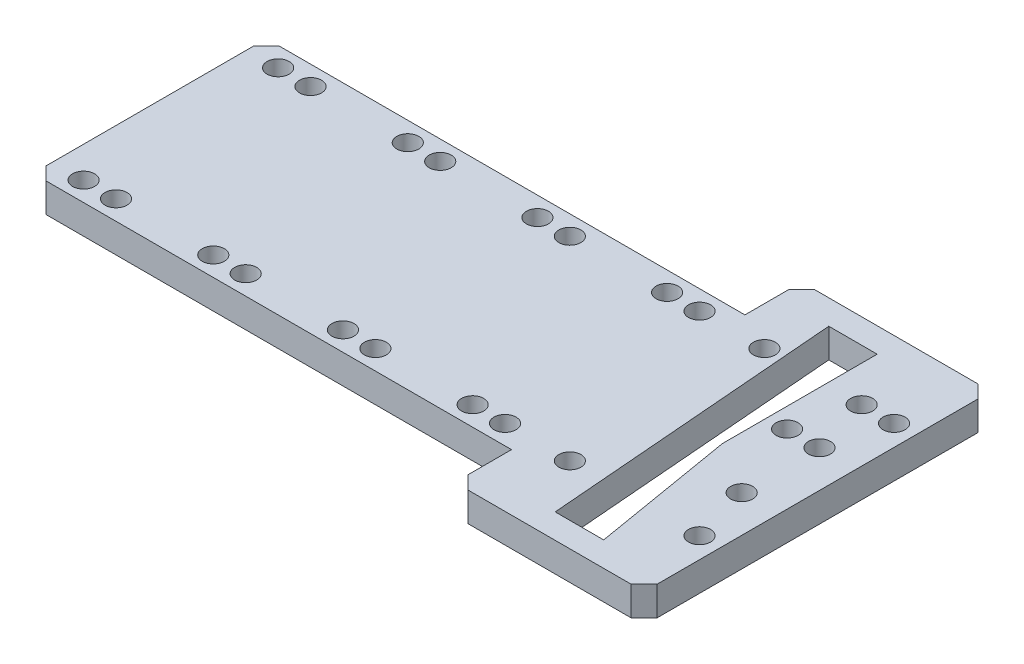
ISO-10303-21;
HEADER;
FILE_DESCRIPTION(('STEP AP214'),'2;1');
FILE_NAME('part.step','',(''),(''),'','','');
FILE_SCHEMA(('AUTOMOTIVE_DESIGN { 1 0 10303 214 1 1 1 1 }'));
ENDSEC;
DATA;
#1=APPLICATION_CONTEXT('core data for automotive mechanical design processes');
#2=APPLICATION_PROTOCOL_DEFINITION('international standard','automotive_design',2000,#1);
#3=PRODUCT_CONTEXT('',#1,'mechanical');
#4=PRODUCT('Part','Part','',(#3));
#5=PRODUCT_RELATED_PRODUCT_CATEGORY('part','',(#4));
#6=PRODUCT_DEFINITION_FORMATION('','',#4);
#7=PRODUCT_DEFINITION_CONTEXT('part definition',#1,'design');
#8=PRODUCT_DEFINITION('design','',#6,#7);
#9=PRODUCT_DEFINITION_SHAPE('','',#8);
#10=(LENGTH_UNIT() NAMED_UNIT(*) SI_UNIT(.MILLI.,.METRE.));
#11=(NAMED_UNIT(*) PLANE_ANGLE_UNIT() SI_UNIT($,.RADIAN.));
#12=(NAMED_UNIT(*) SI_UNIT($,.STERADIAN.) SOLID_ANGLE_UNIT());
#13=UNCERTAINTY_MEASURE_WITH_UNIT(LENGTH_MEASURE(1.E-05),#10,'distance_accuracy_value','');
#14=(GEOMETRIC_REPRESENTATION_CONTEXT(3) GLOBAL_UNCERTAINTY_ASSIGNED_CONTEXT((#13)) GLOBAL_UNIT_ASSIGNED_CONTEXT((#10,
#11,#12)) REPRESENTATION_CONTEXT('',''));
#15=CARTESIAN_POINT('',(0.,0.,0.));
#16=DIRECTION('',(0.,0.,1.));
#17=DIRECTION('',(1.,0.,0.));
#18=AXIS2_PLACEMENT_3D('',#15,#16,#17);
#19=CARTESIAN_POINT('',(0.,4.5,0.));
#20=DIRECTION('',(0.,1.,0.));
#21=DIRECTION('',(0.,0.,1.));
#22=AXIS2_PLACEMENT_3D('',#19,#20,#21);
#23=PLANE('',#22);
#24=CARTESIAN_POINT('',(51.3,4.5,-6.00000000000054));
#25=DIRECTION('',(0.,1.,0.));
#26=DIRECTION('',(0.,0.,1.));
#27=AXIS2_PLACEMENT_3D('',#24,#25,#26);
#28=CIRCLE('',#27,1.7);
#29=CARTESIAN_POINT('',(51.3,4.5,-4.30000000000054));
#30=VERTEX_POINT('',#29);
#31=EDGE_CURVE('E802',#30,#30,#28,.T.);
#32=ORIENTED_EDGE('',*,*,#31,.F.);
#33=EDGE_LOOP('',(#32));
#34=FACE_BOUND('',#33,.T.);
#35=CARTESIAN_POINT('',(33.8,4.5,-14.9999999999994));
#36=DIRECTION('',(0.,1.,0.));
#37=DIRECTION('',(0.,0.,1.));
#38=AXIS2_PLACEMENT_3D('',#35,#36,#37);
#39=CIRCLE('',#38,1.7000000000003);
#40=CARTESIAN_POINT('',(33.8,4.5,-13.2999999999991));
#41=VERTEX_POINT('',#40);
#42=EDGE_CURVE('E814',#41,#41,#39,.T.);
#43=ORIENTED_EDGE('',*,*,#42,.F.);
#44=EDGE_LOOP('',(#43));
#45=FACE_BOUND('',#44,.T.);
#46=CARTESIAN_POINT('',(-21.2,4.5,14.9999999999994));
#47=DIRECTION('',(0.,1.,0.));
#48=DIRECTION('',(0.,0.,-1.));
#49=AXIS2_PLACEMENT_3D('',#46,#47,#48);
#50=CIRCLE('',#49,1.7);
#51=CARTESIAN_POINT('',(-21.2,4.5,13.2999999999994));
#52=VERTEX_POINT('',#51);
#53=EDGE_CURVE('E826',#52,#52,#50,.T.);
#54=ORIENTED_EDGE('',*,*,#53,.F.);
#55=EDGE_LOOP('',(#54));
#56=FACE_BOUND('',#55,.T.);
#57=CARTESIAN_POINT('',(-36.2,4.5,14.9999999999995));
#58=DIRECTION('',(0.,1.,0.));
#59=DIRECTION('',(0.,0.,-1.));
#60=AXIS2_PLACEMENT_3D('',#57,#58,#59);
#61=CIRCLE('',#60,1.7);
#62=CARTESIAN_POINT('',(-36.2,4.5,13.2999999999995));
#63=VERTEX_POINT('',#62);
#64=EDGE_CURVE('E838',#63,#63,#61,.T.);
#65=ORIENTED_EDGE('',*,*,#64,.F.);
#66=EDGE_LOOP('',(#65));
#67=FACE_BOUND('',#66,.T.);
#68=CARTESIAN_POINT('',(-1.19999999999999,4.5,14.9999999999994));
#69=DIRECTION('',(0.,1.,0.));
#70=DIRECTION('',(0.,0.,-1.));
#71=AXIS2_PLACEMENT_3D('',#68,#69,#70);
#72=CIRCLE('',#71,1.7);
#73=CARTESIAN_POINT('',(-1.19999999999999,4.5,13.2999999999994));
#74=VERTEX_POINT('',#73);
#75=EDGE_CURVE('E850',#74,#74,#72,.T.);
#76=ORIENTED_EDGE('',*,*,#75,.F.);
#77=EDGE_LOOP('',(#76));
#78=FACE_BOUND('',#77,.T.);
#79=CARTESIAN_POINT('',(-41.2,4.5,-14.9999999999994));
#80=DIRECTION('',(0.,1.,0.));
#81=DIRECTION('',(0.,0.,1.));
#82=AXIS2_PLACEMENT_3D('',#79,#80,#81);
#83=CIRCLE('',#82,1.7);
#84=CARTESIAN_POINT('',(-41.2,4.5,-13.2999999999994));
#85=VERTEX_POINT('',#84);
#86=EDGE_CURVE('E862',#85,#85,#83,.T.);
#87=ORIENTED_EDGE('',*,*,#86,.F.);
#88=EDGE_LOOP('',(#87));
#89=FACE_BOUND('',#88,.T.);
#90=CARTESIAN_POINT('',(23.8,4.5,14.9999999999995));
#91=DIRECTION('',(0.,1.,0.));
#92=DIRECTION('',(0.,0.,-1.));
#93=AXIS2_PLACEMENT_3D('',#90,#91,#92);
#94=CIRCLE('',#93,1.7);
#95=CARTESIAN_POINT('',(23.8,4.5,13.2999999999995));
#96=VERTEX_POINT('',#95);
#97=EDGE_CURVE('E874',#96,#96,#94,.T.);
#98=ORIENTED_EDGE('',*,*,#97,.F.);
#99=EDGE_LOOP('',(#98));
#100=FACE_BOUND('',#99,.T.);
#101=CARTESIAN_POINT('',(23.8,4.5,-14.9999999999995));
#102=DIRECTION('',(0.,1.,0.));
#103=DIRECTION('',(0.,0.,1.));
#104=AXIS2_PLACEMENT_3D('',#101,#102,#103);
#105=CIRCLE('',#104,1.7);
#106=CARTESIAN_POINT('',(23.8,4.5,-13.2999999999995));
#107=VERTEX_POINT('',#106);
#108=EDGE_CURVE('E886',#107,#107,#105,.T.);
#109=ORIENTED_EDGE('',*,*,#108,.F.);
#110=EDGE_LOOP('',(#109));
#111=FACE_BOUND('',#110,.T.);
#112=CARTESIAN_POINT('',(3.80000000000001,4.5,-14.9999999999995));
#113=DIRECTION('',(0.,1.,0.));
#114=DIRECTION('',(0.,0.,1.));
#115=AXIS2_PLACEMENT_3D('',#112,#113,#114);
#116=CIRCLE('',#115,1.7);
#117=CARTESIAN_POINT('',(3.80000000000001,4.5,-13.2999999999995));
#118=VERTEX_POINT('',#117);
#119=EDGE_CURVE('E898',#118,#118,#116,.T.);
#120=ORIENTED_EDGE('',*,*,#119,.F.);
#121=EDGE_LOOP('',(#120));
#122=FACE_BOUND('',#121,.T.);
#123=CARTESIAN_POINT('',(-16.2,4.5,-14.9999999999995));
#124=DIRECTION('',(0.,1.,0.));
#125=DIRECTION('',(0.,0.,1.));
#126=AXIS2_PLACEMENT_3D('',#123,#124,#125);
#127=CIRCLE('',#126,1.7);
#128=CARTESIAN_POINT('',(-16.2,4.5,-13.2999999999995));
#129=VERTEX_POINT('',#128);
#130=EDGE_CURVE('E910',#129,#129,#127,.T.);
#131=ORIENTED_EDGE('',*,*,#130,.F.);
#132=EDGE_LOOP('',(#131));
#133=FACE_BOUND('',#132,.T.);
#134=CARTESIAN_POINT('',(53.8,4.5,14.9999999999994));
#135=DIRECTION('',(0.,1.,0.));
#136=DIRECTION('',(0.,0.,-1.));
#137=AXIS2_PLACEMENT_3D('',#134,#135,#136);
#138=CIRCLE('',#137,1.7000000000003);
#139=CARTESIAN_POINT('',(53.8,4.5,13.2999999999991));
#140=VERTEX_POINT('',#139);
#141=EDGE_CURVE('E922',#140,#140,#138,.T.);
#142=ORIENTED_EDGE('',*,*,#141,.F.);
#143=EDGE_LOOP('',(#142));
#144=FACE_BOUND('',#143,.T.);
#145=CARTESIAN_POINT('',(53.8,4.5,-14.9999999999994));
#146=DIRECTION('',(0.,1.,0.));
#147=DIRECTION('',(0.,0.,1.));
#148=AXIS2_PLACEMENT_3D('',#145,#146,#147);
#149=CIRCLE('',#148,1.7000000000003);
#150=CARTESIAN_POINT('',(53.8,4.5,-13.2999999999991));
#151=VERTEX_POINT('',#150);
#152=EDGE_CURVE('E196',#151,#151,#149,.T.);
#153=ORIENTED_EDGE('',*,*,#152,.F.);
#154=EDGE_LOOP('',(#153));
#155=FACE_BOUND('',#154,.T.);
#156=DIRECTION('',(0.,0.,-1.));
#157=VECTOR('',#156,1.);
#158=CARTESIAN_POINT('',(56.9999999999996,4.5,24.7499999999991));
#159=LINE('',#158,#157);
#160=CARTESIAN_POINT('',(56.9999999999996,4.5,24.7499999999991));
#161=VERTEX_POINT('',#160);
#162=CARTESIAN_POINT('',(57.0000000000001,4.5,-24.7500000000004));
#163=VERTEX_POINT('',#162);
#164=EDGE_CURVE('E211',#161,#163,#159,.T.);
#165=ORIENTED_EDGE('',*,*,#164,.T.);
#166=DIRECTION('',(-0.707106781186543,0.,-0.707106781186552));
#167=VECTOR('',#166,1.);
#168=CARTESIAN_POINT('',(57.0000000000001,4.5,-24.7500000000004));
#169=LINE('',#168,#167);
#170=CARTESIAN_POINT('',(55.0000000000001,4.5,-26.7500000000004));
#171=VERTEX_POINT('',#170);
#172=EDGE_CURVE('E214',#163,#171,#169,.T.);
#173=ORIENTED_EDGE('',*,*,#172,.T.);
#174=DIRECTION('',(-1.,0.,0.));
#175=VECTOR('',#174,1.);
#176=CARTESIAN_POINT('',(55.0000000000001,4.5,-26.7500000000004));
#177=LINE('',#176,#175);
#178=CARTESIAN_POINT('',(29.8,4.5,-26.7500000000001));
#179=VERTEX_POINT('',#178);
#180=EDGE_CURVE('E217',#171,#179,#177,.T.);
#181=ORIENTED_EDGE('',*,*,#180,.T.);
#182=DIRECTION('',(-0.707106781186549,0.,0.707106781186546));
#183=VECTOR('',#182,1.);
#184=CARTESIAN_POINT('',(27.8,4.5,-24.7500000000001));
#185=LINE('',#184,#183);
#186=CARTESIAN_POINT('',(27.8,4.5,-24.7500000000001));
#187=VERTEX_POINT('',#186);
#188=EDGE_CURVE('E219',#179,#187,#185,.T.);
#189=ORIENTED_EDGE('',*,*,#188,.T.);
#190=DIRECTION('',(0.,0.,1.));
#191=VECTOR('',#190,1.);
#192=CARTESIAN_POINT('',(27.7999999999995,4.5,-17.9999999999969));
#193=LINE('',#192,#191);
#194=CARTESIAN_POINT('',(27.7999999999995,4.5,-17.9999999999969));
#195=VERTEX_POINT('',#194);
#196=EDGE_CURVE('E221',#187,#195,#193,.T.);
#197=ORIENTED_EDGE('',*,*,#196,.T.);
#198=DIRECTION('',(-1.,0.,0.));
#199=VECTOR('',#198,1.);
#200=CARTESIAN_POINT('',(-43.9999999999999,4.5,-17.9999999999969));
#201=LINE('',#200,#199);
#202=CARTESIAN_POINT('',(-43.9999999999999,4.5,-17.9999999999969));
#203=VERTEX_POINT('',#202);
#204=EDGE_CURVE('E223',#195,#203,#201,.T.);
#205=ORIENTED_EDGE('',*,*,#204,.T.);
#206=DIRECTION('',(-0.707106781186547,0.,0.707106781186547));
#207=VECTOR('',#206,1.);
#208=CARTESIAN_POINT('',(-43.9999999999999,4.5,-17.9999999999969));
#209=LINE('',#208,#207);
#210=CARTESIAN_POINT('',(-45.9999999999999,4.5,-15.9999999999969));
#211=VERTEX_POINT('',#210);
#212=EDGE_CURVE('E225',#203,#211,#209,.T.);
#213=ORIENTED_EDGE('',*,*,#212,.T.);
#214=DIRECTION('',(0.,0.,1.));
#215=VECTOR('',#214,1.);
#216=CARTESIAN_POINT('',(-45.9999999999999,4.5,-15.9999999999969));
#217=LINE('',#216,#215);
#218=CARTESIAN_POINT('',(-45.9999999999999,4.5,15.9999999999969));
#219=VERTEX_POINT('',#218);
#220=EDGE_CURVE('E227',#211,#219,#217,.T.);
#221=ORIENTED_EDGE('',*,*,#220,.T.);
#222=DIRECTION('',(0.707106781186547,0.,0.707106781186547));
#223=VECTOR('',#222,1.);
#224=CARTESIAN_POINT('',(-45.9999999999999,4.5,15.9999999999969));
#225=LINE('',#224,#223);
#226=CARTESIAN_POINT('',(-43.9999999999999,4.5,17.9999999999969));
#227=VERTEX_POINT('',#226);
#228=EDGE_CURVE('E229',#219,#227,#225,.T.);
#229=ORIENTED_EDGE('',*,*,#228,.T.);
#230=DIRECTION('',(1.,0.,0.));
#231=VECTOR('',#230,1.);
#232=CARTESIAN_POINT('',(-43.9999999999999,4.5,17.9999999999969));
#233=LINE('',#232,#231);
#234=CARTESIAN_POINT('',(27.7999999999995,4.5,17.9999999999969));
#235=VERTEX_POINT('',#234);
#236=EDGE_CURVE('E231',#227,#235,#233,.T.);
#237=ORIENTED_EDGE('',*,*,#236,.T.);
#238=DIRECTION('',(0.,0.,1.));
#239=VECTOR('',#238,1.);
#240=CARTESIAN_POINT('',(27.7999999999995,4.5,17.9999999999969));
#241=LINE('',#240,#239);
#242=CARTESIAN_POINT('',(27.7999999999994,4.5,24.7499999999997));
#243=VERTEX_POINT('',#242);
#244=EDGE_CURVE('E233',#235,#243,#241,.T.);
#245=ORIENTED_EDGE('',*,*,#244,.T.);
#246=DIRECTION('',(0.707106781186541,0.,0.707106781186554));
#247=VECTOR('',#246,1.);
#248=CARTESIAN_POINT('',(27.7999999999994,4.5,24.7499999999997));
#249=LINE('',#248,#247);
#250=CARTESIAN_POINT('',(29.7999999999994,4.5,26.7499999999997));
#251=VERTEX_POINT('',#250);
#252=EDGE_CURVE('E235',#243,#251,#249,.T.);
#253=ORIENTED_EDGE('',*,*,#252,.T.);
#254=DIRECTION('',(1.,0.,0.));
#255=VECTOR('',#254,1.);
#256=CARTESIAN_POINT('',(54.9999999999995,4.5,26.7499999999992));
#257=LINE('',#256,#255);
#258=CARTESIAN_POINT('',(54.9999999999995,4.5,26.7499999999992));
#259=VERTEX_POINT('',#258);
#260=EDGE_CURVE('E237',#251,#259,#257,.T.);
#261=ORIENTED_EDGE('',*,*,#260,.T.);
#262=DIRECTION('',(0.707106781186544,0.,-0.707106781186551));
#263=VECTOR('',#262,1.);
#264=CARTESIAN_POINT('',(54.9999999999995,4.5,26.7499999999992));
#265=LINE('',#264,#263);
#266=EDGE_CURVE('E239',#259,#161,#265,.T.);
#267=ORIENTED_EDGE('',*,*,#266,.T.);
#268=EDGE_LOOP('',(#165,#173,#181,#189,#197,#205,#213,#221,#229,#237,#245,#253,#261,#267));
#269=FACE_BOUND('',#268,.T.);
#270=DIRECTION('',(-0.166195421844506,0.,-0.986092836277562));
#271=VECTOR('',#270,1.);
#272=CARTESIAN_POINT('',(43.25,4.5,0.912138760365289));
#273=LINE('',#272,#271);
#274=CARTESIAN_POINT('',(46.9642462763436,4.5,22.9500000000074));
#275=VERTEX_POINT('',#274);
#276=CARTESIAN_POINT('',(43.25,4.5,0.912138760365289));
#277=VERTEX_POINT('',#276);
#278=EDGE_CURVE('E172',#275,#277,#273,.T.);
#279=ORIENTED_EDGE('',*,*,#278,.F.);
#280=DIRECTION('',(1.,0.,0.));
#281=VECTOR('',#280,1.);
#282=CARTESIAN_POINT('',(46.9642462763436,4.5,22.9500000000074));
#283=LINE('',#282,#281);
#284=CARTESIAN_POINT('',(39.4842462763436,4.5,22.9500000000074));
#285=VERTEX_POINT('',#284);
#286=EDGE_CURVE('E164',#285,#275,#283,.T.);
#287=ORIENTED_EDGE('',*,*,#286,.F.);
#288=DIRECTION('',(0.0803714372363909,0.,0.996764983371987));
#289=VECTOR('',#288,1.);
#290=CARTESIAN_POINT('',(39.4842462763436,4.5,22.9500000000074));
#291=LINE('',#290,#289);
#292=CARTESIAN_POINT('',(35.7832244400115,4.5,-22.95));
#293=VERTEX_POINT('',#292);
#294=EDGE_CURVE('E193',#293,#285,#291,.T.);
#295=ORIENTED_EDGE('',*,*,#294,.F.);
#296=DIRECTION('',(-1.,0.,0.));
#297=VECTOR('',#296,1.);
#298=CARTESIAN_POINT('',(35.7832244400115,4.5,-22.95));
#299=LINE('',#298,#297);
#300=CARTESIAN_POINT('',(43.25,4.5,-22.95));
#301=VERTEX_POINT('',#300);
#302=EDGE_CURVE('E188',#301,#293,#299,.T.);
#303=ORIENTED_EDGE('',*,*,#302,.F.);
#304=DIRECTION('',(0.,0.,-1.));
#305=VECTOR('',#304,1.);
#306=CARTESIAN_POINT('',(43.25,4.5,-22.95));
#307=LINE('',#306,#305);
#308=EDGE_CURVE('E186',#277,#301,#307,.T.);
#309=ORIENTED_EDGE('',*,*,#308,.F.);
#310=EDGE_LOOP('',(#279,#287,#295,#303,#309));
#311=FACE_BOUND('',#310,.T.);
#312=CARTESIAN_POINT('',(48.8,4.5,-14.9999999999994));
#313=DIRECTION('',(0.,1.,0.));
#314=DIRECTION('',(0.,0.,1.));
#315=AXIS2_PLACEMENT_3D('',#312,#313,#314);
#316=CIRCLE('',#315,1.7000000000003);
#317=CARTESIAN_POINT('',(48.8,4.5,-13.2999999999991));
#318=VERTEX_POINT('',#317);
#319=EDGE_CURVE('E928',#318,#318,#316,.T.);
#320=ORIENTED_EDGE('',*,*,#319,.F.);
#321=EDGE_LOOP('',(#320));
#322=FACE_BOUND('',#321,.T.);
#323=CARTESIAN_POINT('',(-21.2,4.5,-14.9999999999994));
#324=DIRECTION('',(0.,1.,0.));
#325=DIRECTION('',(0.,0.,1.));
#326=AXIS2_PLACEMENT_3D('',#323,#324,#325);
#327=CIRCLE('',#326,1.7);
#328=CARTESIAN_POINT('',(-21.2,4.5,-13.2999999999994));
#329=VERTEX_POINT('',#328);
#330=EDGE_CURVE('E916',#329,#329,#327,.T.);
#331=ORIENTED_EDGE('',*,*,#330,.F.);
#332=EDGE_LOOP('',(#331));
#333=FACE_BOUND('',#332,.T.);
#334=CARTESIAN_POINT('',(-1.19999999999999,4.5,-14.9999999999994));
#335=DIRECTION('',(0.,1.,0.));
#336=DIRECTION('',(0.,0.,1.));
#337=AXIS2_PLACEMENT_3D('',#334,#335,#336);
#338=CIRCLE('',#337,1.7);
#339=CARTESIAN_POINT('',(-1.19999999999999,4.5,-13.2999999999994));
#340=VERTEX_POINT('',#339);
#341=EDGE_CURVE('E904',#340,#340,#338,.T.);
#342=ORIENTED_EDGE('',*,*,#341,.F.);
#343=EDGE_LOOP('',(#342));
#344=FACE_BOUND('',#343,.T.);
#345=CARTESIAN_POINT('',(18.8,4.5,-14.9999999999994));
#346=DIRECTION('',(0.,1.,0.));
#347=DIRECTION('',(0.,0.,1.));
#348=AXIS2_PLACEMENT_3D('',#345,#346,#347);
#349=CIRCLE('',#348,1.7);
#350=CARTESIAN_POINT('',(18.8,4.5,-13.2999999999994));
#351=VERTEX_POINT('',#350);
#352=EDGE_CURVE('E892',#351,#351,#349,.T.);
#353=ORIENTED_EDGE('',*,*,#352,.F.);
#354=EDGE_LOOP('',(#353));
#355=FACE_BOUND('',#354,.T.);
#356=CARTESIAN_POINT('',(33.8,4.5,14.9999999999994));
#357=DIRECTION('',(0.,1.,0.));
#358=DIRECTION('',(0.,0.,-1.));
#359=AXIS2_PLACEMENT_3D('',#356,#357,#358);
#360=CIRCLE('',#359,1.7000000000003);
#361=CARTESIAN_POINT('',(33.8,4.5,13.2999999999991));
#362=VERTEX_POINT('',#361);
#363=EDGE_CURVE('E880',#362,#362,#360,.T.);
#364=ORIENTED_EDGE('',*,*,#363,.F.);
#365=EDGE_LOOP('',(#364));
#366=FACE_BOUND('',#365,.T.);
#367=CARTESIAN_POINT('',(18.8,4.5,14.9999999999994));
#368=DIRECTION('',(0.,1.,0.));
#369=DIRECTION('',(0.,0.,-1.));
#370=AXIS2_PLACEMENT_3D('',#367,#368,#369);
#371=CIRCLE('',#370,1.7);
#372=CARTESIAN_POINT('',(18.8,4.5,13.2999999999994));
#373=VERTEX_POINT('',#372);
#374=EDGE_CURVE('E868',#373,#373,#371,.T.);
#375=ORIENTED_EDGE('',*,*,#374,.F.);
#376=EDGE_LOOP('',(#375));
#377=FACE_BOUND('',#376,.T.);
#378=CARTESIAN_POINT('',(3.80000000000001,4.5,14.9999999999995));
#379=DIRECTION('',(0.,1.,0.));
#380=DIRECTION('',(0.,0.,-1.));
#381=AXIS2_PLACEMENT_3D('',#378,#379,#380);
#382=CIRCLE('',#381,1.7);
#383=CARTESIAN_POINT('',(3.80000000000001,4.5,13.2999999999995));
#384=VERTEX_POINT('',#383);
#385=EDGE_CURVE('E856',#384,#384,#382,.T.);
#386=ORIENTED_EDGE('',*,*,#385,.F.);
#387=EDGE_LOOP('',(#386));
#388=FACE_BOUND('',#387,.T.);
#389=CARTESIAN_POINT('',(-36.2,4.5,-14.9999999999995));
#390=DIRECTION('',(0.,1.,0.));
#391=DIRECTION('',(0.,0.,1.));
#392=AXIS2_PLACEMENT_3D('',#389,#390,#391);
#393=CIRCLE('',#392,1.7);
#394=CARTESIAN_POINT('',(-36.2,4.5,-13.2999999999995));
#395=VERTEX_POINT('',#394);
#396=EDGE_CURVE('E844',#395,#395,#393,.T.);
#397=ORIENTED_EDGE('',*,*,#396,.F.);
#398=EDGE_LOOP('',(#397));
#399=FACE_BOUND('',#398,.T.);
#400=CARTESIAN_POINT('',(-16.2,4.5,14.9999999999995));
#401=DIRECTION('',(0.,1.,0.));
#402=DIRECTION('',(0.,0.,-1.));
#403=AXIS2_PLACEMENT_3D('',#400,#401,#402);
#404=CIRCLE('',#403,1.7);
#405=CARTESIAN_POINT('',(-16.2,4.5,13.2999999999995));
#406=VERTEX_POINT('',#405);
#407=EDGE_CURVE('E832',#406,#406,#404,.T.);
#408=ORIENTED_EDGE('',*,*,#407,.F.);
#409=EDGE_LOOP('',(#408));
#410=FACE_BOUND('',#409,.T.);
#411=CARTESIAN_POINT('',(-41.2,4.5,14.9999999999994));
#412=DIRECTION('',(0.,1.,0.));
#413=DIRECTION('',(0.,0.,-1.));
#414=AXIS2_PLACEMENT_3D('',#411,#412,#413);
#415=CIRCLE('',#414,1.7);
#416=CARTESIAN_POINT('',(-41.2,4.5,13.2999999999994));
#417=VERTEX_POINT('',#416);
#418=EDGE_CURVE('E820',#417,#417,#415,.T.);
#419=ORIENTED_EDGE('',*,*,#418,.F.);
#420=EDGE_LOOP('',(#419));
#421=FACE_BOUND('',#420,.T.);
#422=CARTESIAN_POINT('',(46.3,4.5,-6.00000000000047));
#423=DIRECTION('',(0.,1.,0.));
#424=DIRECTION('',(0.,0.,1.));
#425=AXIS2_PLACEMENT_3D('',#422,#423,#424);
#426=CIRCLE('',#425,1.7);
#427=CARTESIAN_POINT('',(46.3,4.5,-4.30000000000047));
#428=VERTEX_POINT('',#427);
#429=EDGE_CURVE('E808',#428,#428,#426,.T.);
#430=ORIENTED_EDGE('',*,*,#429,.F.);
#431=EDGE_LOOP('',(#430));
#432=FACE_BOUND('',#431,.T.);
#433=CARTESIAN_POINT('',(51.3,4.5,5.99999999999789));
#434=DIRECTION('',(0.,1.,0.));
#435=DIRECTION('',(0.,0.,1.));
#436=AXIS2_PLACEMENT_3D('',#433,#434,#435);
#437=CIRCLE('',#436,1.7);
#438=CARTESIAN_POINT('',(51.3,4.5,7.69999999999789));
#439=VERTEX_POINT('',#438);
#440=EDGE_CURVE('E793',#439,#439,#437,.T.);
#441=ORIENTED_EDGE('',*,*,#440,.F.);
#442=EDGE_LOOP('',(#441));
#443=FACE_BOUND('',#442,.T.);
#444=ADVANCED_FACE('F33',(#34,#45,#56,#67,#78,#89,#100,#111,#122,#133,#144,#155,#269,#311,#322,
#333,#344,#355,#366,#377,#388,#399,#410,#421,#432,#443),#23,.T.);
#445=CARTESIAN_POINT('',(0.,0.,0.));
#446=DIRECTION('',(0.,1.,0.));
#447=DIRECTION('',(0.,0.,1.));
#448=AXIS2_PLACEMENT_3D('',#445,#446,#447);
#449=PLANE('',#448);
#450=CARTESIAN_POINT('',(51.3,0.,-6.00000000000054));
#451=DIRECTION('',(0.,1.,0.));
#452=DIRECTION('',(0.,0.,1.));
#453=AXIS2_PLACEMENT_3D('',#450,#451,#452);
#454=CIRCLE('',#453,1.7);
#455=CARTESIAN_POINT('',(51.3,0.,-4.30000000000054));
#456=VERTEX_POINT('',#455);
#457=EDGE_CURVE('E799',#456,#456,#454,.T.);
#458=ORIENTED_EDGE('',*,*,#457,.T.);
#459=EDGE_LOOP('',(#458));
#460=FACE_BOUND('',#459,.T.);
#461=CARTESIAN_POINT('',(33.8,0.,-14.9999999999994));
#462=DIRECTION('',(0.,1.,0.));
#463=DIRECTION('',(0.,0.,1.));
#464=AXIS2_PLACEMENT_3D('',#461,#462,#463);
#465=CIRCLE('',#464,1.7000000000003);
#466=CARTESIAN_POINT('',(33.8,0.,-13.2999999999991));
#467=VERTEX_POINT('',#466);
#468=EDGE_CURVE('E811',#467,#467,#465,.T.);
#469=ORIENTED_EDGE('',*,*,#468,.T.);
#470=EDGE_LOOP('',(#469));
#471=FACE_BOUND('',#470,.T.);
#472=CARTESIAN_POINT('',(-21.2,0.,14.9999999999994));
#473=DIRECTION('',(0.,1.,0.));
#474=DIRECTION('',(0.,0.,-1.));
#475=AXIS2_PLACEMENT_3D('',#472,#473,#474);
#476=CIRCLE('',#475,1.7);
#477=CARTESIAN_POINT('',(-21.2,0.,13.2999999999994));
#478=VERTEX_POINT('',#477);
#479=EDGE_CURVE('E823',#478,#478,#476,.T.);
#480=ORIENTED_EDGE('',*,*,#479,.T.);
#481=EDGE_LOOP('',(#480));
#482=FACE_BOUND('',#481,.T.);
#483=CARTESIAN_POINT('',(-36.2,0.,14.9999999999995));
#484=DIRECTION('',(0.,1.,0.));
#485=DIRECTION('',(0.,0.,-1.));
#486=AXIS2_PLACEMENT_3D('',#483,#484,#485);
#487=CIRCLE('',#486,1.7);
#488=CARTESIAN_POINT('',(-36.2,0.,13.2999999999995));
#489=VERTEX_POINT('',#488);
#490=EDGE_CURVE('E835',#489,#489,#487,.T.);
#491=ORIENTED_EDGE('',*,*,#490,.T.);
#492=EDGE_LOOP('',(#491));
#493=FACE_BOUND('',#492,.T.);
#494=CARTESIAN_POINT('',(-1.19999999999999,0.,14.9999999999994));
#495=DIRECTION('',(0.,1.,0.));
#496=DIRECTION('',(0.,0.,-1.));
#497=AXIS2_PLACEMENT_3D('',#494,#495,#496);
#498=CIRCLE('',#497,1.7);
#499=CARTESIAN_POINT('',(-1.19999999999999,0.,13.2999999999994));
#500=VERTEX_POINT('',#499);
#501=EDGE_CURVE('E847',#500,#500,#498,.T.);
#502=ORIENTED_EDGE('',*,*,#501,.T.);
#503=EDGE_LOOP('',(#502));
#504=FACE_BOUND('',#503,.T.);
#505=CARTESIAN_POINT('',(-41.2,0.,-14.9999999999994));
#506=DIRECTION('',(0.,1.,0.));
#507=DIRECTION('',(0.,0.,1.));
#508=AXIS2_PLACEMENT_3D('',#505,#506,#507);
#509=CIRCLE('',#508,1.7);
#510=CARTESIAN_POINT('',(-41.2,0.,-13.2999999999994));
#511=VERTEX_POINT('',#510);
#512=EDGE_CURVE('E859',#511,#511,#509,.T.);
#513=ORIENTED_EDGE('',*,*,#512,.T.);
#514=EDGE_LOOP('',(#513));
#515=FACE_BOUND('',#514,.T.);
#516=CARTESIAN_POINT('',(23.8,0.,14.9999999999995));
#517=DIRECTION('',(0.,1.,0.));
#518=DIRECTION('',(0.,0.,-1.));
#519=AXIS2_PLACEMENT_3D('',#516,#517,#518);
#520=CIRCLE('',#519,1.7);
#521=CARTESIAN_POINT('',(23.8,0.,13.2999999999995));
#522=VERTEX_POINT('',#521);
#523=EDGE_CURVE('E871',#522,#522,#520,.T.);
#524=ORIENTED_EDGE('',*,*,#523,.T.);
#525=EDGE_LOOP('',(#524));
#526=FACE_BOUND('',#525,.T.);
#527=CARTESIAN_POINT('',(23.8,0.,-14.9999999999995));
#528=DIRECTION('',(0.,1.,0.));
#529=DIRECTION('',(0.,0.,1.));
#530=AXIS2_PLACEMENT_3D('',#527,#528,#529);
#531=CIRCLE('',#530,1.7);
#532=CARTESIAN_POINT('',(23.8,0.,-13.2999999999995));
#533=VERTEX_POINT('',#532);
#534=EDGE_CURVE('E883',#533,#533,#531,.T.);
#535=ORIENTED_EDGE('',*,*,#534,.T.);
#536=EDGE_LOOP('',(#535));
#537=FACE_BOUND('',#536,.T.);
#538=CARTESIAN_POINT('',(3.80000000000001,0.,-14.9999999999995));
#539=DIRECTION('',(0.,1.,0.));
#540=DIRECTION('',(0.,0.,1.));
#541=AXIS2_PLACEMENT_3D('',#538,#539,#540);
#542=CIRCLE('',#541,1.7);
#543=CARTESIAN_POINT('',(3.80000000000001,0.,-13.2999999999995));
#544=VERTEX_POINT('',#543);
#545=EDGE_CURVE('E895',#544,#544,#542,.T.);
#546=ORIENTED_EDGE('',*,*,#545,.T.);
#547=EDGE_LOOP('',(#546));
#548=FACE_BOUND('',#547,.T.);
#549=CARTESIAN_POINT('',(-16.2,0.,-14.9999999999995));
#550=DIRECTION('',(0.,1.,0.));
#551=DIRECTION('',(0.,0.,1.));
#552=AXIS2_PLACEMENT_3D('',#549,#550,#551);
#553=CIRCLE('',#552,1.7);
#554=CARTESIAN_POINT('',(-16.2,0.,-13.2999999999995));
#555=VERTEX_POINT('',#554);
#556=EDGE_CURVE('E907',#555,#555,#553,.T.);
#557=ORIENTED_EDGE('',*,*,#556,.T.);
#558=EDGE_LOOP('',(#557));
#559=FACE_BOUND('',#558,.T.);
#560=CARTESIAN_POINT('',(53.8,0.,14.9999999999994));
#561=DIRECTION('',(0.,1.,0.));
#562=DIRECTION('',(0.,0.,-1.));
#563=AXIS2_PLACEMENT_3D('',#560,#561,#562);
#564=CIRCLE('',#563,1.7000000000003);
#565=CARTESIAN_POINT('',(53.8,0.,13.2999999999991));
#566=VERTEX_POINT('',#565);
#567=EDGE_CURVE('E919',#566,#566,#564,.T.);
#568=ORIENTED_EDGE('',*,*,#567,.T.);
#569=EDGE_LOOP('',(#568));
#570=FACE_BOUND('',#569,.T.);
#571=CARTESIAN_POINT('',(53.8,0.,-14.9999999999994));
#572=DIRECTION('',(0.,1.,0.));
#573=DIRECTION('',(0.,0.,1.));
#574=AXIS2_PLACEMENT_3D('',#571,#572,#573);
#575=CIRCLE('',#574,1.7000000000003);
#576=CARTESIAN_POINT('',(53.8,0.,-13.2999999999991));
#577=VERTEX_POINT('',#576);
#578=EDGE_CURVE('E931',#577,#577,#575,.T.);
#579=ORIENTED_EDGE('',*,*,#578,.T.);
#580=EDGE_LOOP('',(#579));
#581=FACE_BOUND('',#580,.T.);
#582=DIRECTION('',(0.,0.,-1.));
#583=VECTOR('',#582,1.);
#584=CARTESIAN_POINT('',(56.9999999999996,0.,24.7499999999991));
#585=LINE('',#584,#583);
#586=CARTESIAN_POINT('',(56.9999999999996,0.,24.7499999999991));
#587=VERTEX_POINT('',#586);
#588=CARTESIAN_POINT('',(57.0000000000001,0.,-24.7500000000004));
#589=VERTEX_POINT('',#588);
#590=EDGE_CURVE('E180',#587,#589,#585,.T.);
#591=ORIENTED_EDGE('',*,*,#590,.F.);
#592=DIRECTION('',(0.707106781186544,0.,-0.707106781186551));
#593=VECTOR('',#592,1.);
#594=CARTESIAN_POINT('',(54.9999999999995,0.,26.7499999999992));
#595=LINE('',#594,#593);
#596=CARTESIAN_POINT('',(54.9999999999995,0.,26.7499999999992));
#597=VERTEX_POINT('',#596);
#598=EDGE_CURVE('E215',#597,#587,#595,.T.);
#599=ORIENTED_EDGE('',*,*,#598,.F.);
#600=DIRECTION('',(1.,0.,0.));
#601=VECTOR('',#600,1.);
#602=CARTESIAN_POINT('',(54.9999999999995,0.,26.7499999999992));
#603=LINE('',#602,#601);
#604=CARTESIAN_POINT('',(29.7999999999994,0.,26.7499999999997));
#605=VERTEX_POINT('',#604);
#606=EDGE_CURVE('E266',#605,#597,#603,.T.);
#607=ORIENTED_EDGE('',*,*,#606,.F.);
#608=DIRECTION('',(0.707106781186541,0.,0.707106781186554));
#609=VECTOR('',#608,1.);
#610=CARTESIAN_POINT('',(27.7999999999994,0.,24.7499999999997));
#611=LINE('',#610,#609);
#612=CARTESIAN_POINT('',(27.7999999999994,0.,24.7499999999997));
#613=VERTEX_POINT('',#612);
#614=EDGE_CURVE('E264',#613,#605,#611,.T.);
#615=ORIENTED_EDGE('',*,*,#614,.F.);
#616=DIRECTION('',(0.,0.,1.));
#617=VECTOR('',#616,1.);
#618=CARTESIAN_POINT('',(27.7999999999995,0.,17.9999999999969));
#619=LINE('',#618,#617);
#620=CARTESIAN_POINT('',(27.7999999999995,0.,17.9999999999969));
#621=VERTEX_POINT('',#620);
#622=EDGE_CURVE('E262',#621,#613,#619,.T.);
#623=ORIENTED_EDGE('',*,*,#622,.F.);
#624=DIRECTION('',(1.,0.,0.));
#625=VECTOR('',#624,1.);
#626=CARTESIAN_POINT('',(-43.9999999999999,0.,17.9999999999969));
#627=LINE('',#626,#625);
#628=CARTESIAN_POINT('',(-43.9999999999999,0.,17.9999999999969));
#629=VERTEX_POINT('',#628);
#630=EDGE_CURVE('E260',#629,#621,#627,.T.);
#631=ORIENTED_EDGE('',*,*,#630,.F.);
#632=DIRECTION('',(0.707106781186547,0.,0.707106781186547));
#633=VECTOR('',#632,1.);
#634=CARTESIAN_POINT('',(-45.9999999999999,0.,15.9999999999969));
#635=LINE('',#634,#633);
#636=CARTESIAN_POINT('',(-45.9999999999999,0.,15.9999999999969));
#637=VERTEX_POINT('',#636);
#638=EDGE_CURVE('E258',#637,#629,#635,.T.);
#639=ORIENTED_EDGE('',*,*,#638,.F.);
#640=DIRECTION('',(0.,0.,1.));
#641=VECTOR('',#640,1.);
#642=CARTESIAN_POINT('',(-45.9999999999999,0.,-15.9999999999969));
#643=LINE('',#642,#641);
#644=CARTESIAN_POINT('',(-45.9999999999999,0.,-15.9999999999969));
#645=VERTEX_POINT('',#644);
#646=EDGE_CURVE('E256',#645,#637,#643,.T.);
#647=ORIENTED_EDGE('',*,*,#646,.F.);
#648=DIRECTION('',(-0.707106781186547,0.,0.707106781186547));
#649=VECTOR('',#648,1.);
#650=CARTESIAN_POINT('',(-43.9999999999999,0.,-17.9999999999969));
#651=LINE('',#650,#649);
#652=CARTESIAN_POINT('',(-43.9999999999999,0.,-17.9999999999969));
#653=VERTEX_POINT('',#652);
#654=EDGE_CURVE('E254',#653,#645,#651,.T.);
#655=ORIENTED_EDGE('',*,*,#654,.F.);
#656=DIRECTION('',(-1.,0.,0.));
#657=VECTOR('',#656,1.);
#658=CARTESIAN_POINT('',(-43.9999999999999,0.,-17.9999999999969));
#659=LINE('',#658,#657);
#660=CARTESIAN_POINT('',(27.7999999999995,0.,-17.9999999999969));
#661=VERTEX_POINT('',#660);
#662=EDGE_CURVE('E252',#661,#653,#659,.T.);
#663=ORIENTED_EDGE('',*,*,#662,.F.);
#664=DIRECTION('',(0.,0.,1.));
#665=VECTOR('',#664,1.);
#666=CARTESIAN_POINT('',(27.7999999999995,0.,-17.9999999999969));
#667=LINE('',#666,#665);
#668=CARTESIAN_POINT('',(27.8,0.,-24.7500000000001));
#669=VERTEX_POINT('',#668);
#670=EDGE_CURVE('E250',#669,#661,#667,.T.);
#671=ORIENTED_EDGE('',*,*,#670,.F.);
#672=DIRECTION('',(-0.707106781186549,0.,0.707106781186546));
#673=VECTOR('',#672,1.);
#674=CARTESIAN_POINT('',(27.8,0.,-24.7500000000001));
#675=LINE('',#674,#673);
#676=CARTESIAN_POINT('',(29.8,0.,-26.7500000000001));
#677=VERTEX_POINT('',#676);
#678=EDGE_CURVE('E248',#677,#669,#675,.T.);
#679=ORIENTED_EDGE('',*,*,#678,.F.);
#680=DIRECTION('',(-1.,0.,0.));
#681=VECTOR('',#680,1.);
#682=CARTESIAN_POINT('',(55.0000000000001,0.,-26.7500000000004));
#683=LINE('',#682,#681);
#684=CARTESIAN_POINT('',(55.0000000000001,0.,-26.7500000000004));
#685=VERTEX_POINT('',#684);
#686=EDGE_CURVE('E246',#685,#677,#683,.T.);
#687=ORIENTED_EDGE('',*,*,#686,.F.);
#688=DIRECTION('',(-0.707106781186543,0.,-0.707106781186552));
#689=VECTOR('',#688,1.);
#690=CARTESIAN_POINT('',(57.0000000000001,0.,-24.7500000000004));
#691=LINE('',#690,#689);
#692=EDGE_CURVE('E244',#589,#685,#691,.T.);
#693=ORIENTED_EDGE('',*,*,#692,.F.);
#694=EDGE_LOOP('',(#591,#599,#607,#615,#623,#631,#639,#647,#655,#663,#671,#679,#687,#693));
#695=FACE_BOUND('',#694,.T.);
#696=DIRECTION('',(1.,0.,0.));
#697=VECTOR('',#696,1.);
#698=CARTESIAN_POINT('',(46.9642462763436,0.,22.9500000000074));
#699=LINE('',#698,#697);
#700=CARTESIAN_POINT('',(39.4842462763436,0.,22.9500000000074));
#701=VERTEX_POINT('',#700);
#702=CARTESIAN_POINT('',(46.9642462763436,0.,22.9500000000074));
#703=VERTEX_POINT('',#702);
#704=EDGE_CURVE('E56',#701,#703,#699,.T.);
#705=ORIENTED_EDGE('',*,*,#704,.T.);
#706=DIRECTION('',(-0.166195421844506,0.,-0.986092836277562));
#707=VECTOR('',#706,1.);
#708=CARTESIAN_POINT('',(43.25,0.,0.912138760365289));
#709=LINE('',#708,#707);
#710=CARTESIAN_POINT('',(43.25,0.,0.912138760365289));
#711=VERTEX_POINT('',#710);
#712=EDGE_CURVE('E179',#703,#711,#709,.T.);
#713=ORIENTED_EDGE('',*,*,#712,.T.);
#714=DIRECTION('',(0.,0.,-1.));
#715=VECTOR('',#714,1.);
#716=CARTESIAN_POINT('',(43.25,0.,-22.95));
#717=LINE('',#716,#715);
#718=CARTESIAN_POINT('',(43.25,0.,-22.95));
#719=VERTEX_POINT('',#718);
#720=EDGE_CURVE('E198',#711,#719,#717,.T.);
#721=ORIENTED_EDGE('',*,*,#720,.T.);
#722=DIRECTION('',(-1.,0.,0.));
#723=VECTOR('',#722,1.);
#724=CARTESIAN_POINT('',(35.7832244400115,0.,-22.95));
#725=LINE('',#724,#723);
#726=CARTESIAN_POINT('',(35.7832244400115,0.,-22.95));
#727=VERTEX_POINT('',#726);
#728=EDGE_CURVE('E201',#719,#727,#725,.T.);
#729=ORIENTED_EDGE('',*,*,#728,.T.);
#730=DIRECTION('',(0.0803714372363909,0.,0.996764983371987));
#731=VECTOR('',#730,1.);
#732=CARTESIAN_POINT('',(39.4842462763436,0.,22.9500000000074));
#733=LINE('',#732,#731);
#734=EDGE_CURVE('E173',#727,#701,#733,.T.);
#735=ORIENTED_EDGE('',*,*,#734,.T.);
#736=EDGE_LOOP('',(#705,#713,#721,#729,#735));
#737=FACE_BOUND('',#736,.T.);
#738=CARTESIAN_POINT('',(48.8,0.,-14.9999999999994));
#739=DIRECTION('',(0.,1.,0.));
#740=DIRECTION('',(0.,0.,1.));
#741=AXIS2_PLACEMENT_3D('',#738,#739,#740);
#742=CIRCLE('',#741,1.7000000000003);
#743=CARTESIAN_POINT('',(48.8,0.,-13.2999999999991));
#744=VERTEX_POINT('',#743);
#745=EDGE_CURVE('E925',#744,#744,#742,.T.);
#746=ORIENTED_EDGE('',*,*,#745,.T.);
#747=EDGE_LOOP('',(#746));
#748=FACE_BOUND('',#747,.T.);
#749=CARTESIAN_POINT('',(-21.2,0.,-14.9999999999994));
#750=DIRECTION('',(0.,1.,0.));
#751=DIRECTION('',(0.,0.,1.));
#752=AXIS2_PLACEMENT_3D('',#749,#750,#751);
#753=CIRCLE('',#752,1.7);
#754=CARTESIAN_POINT('',(-21.2,0.,-13.2999999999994));
#755=VERTEX_POINT('',#754);
#756=EDGE_CURVE('E913',#755,#755,#753,.T.);
#757=ORIENTED_EDGE('',*,*,#756,.T.);
#758=EDGE_LOOP('',(#757));
#759=FACE_BOUND('',#758,.T.);
#760=CARTESIAN_POINT('',(-1.19999999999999,0.,-14.9999999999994));
#761=DIRECTION('',(0.,1.,0.));
#762=DIRECTION('',(0.,0.,1.));
#763=AXIS2_PLACEMENT_3D('',#760,#761,#762);
#764=CIRCLE('',#763,1.7);
#765=CARTESIAN_POINT('',(-1.19999999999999,0.,-13.2999999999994));
#766=VERTEX_POINT('',#765);
#767=EDGE_CURVE('E901',#766,#766,#764,.T.);
#768=ORIENTED_EDGE('',*,*,#767,.T.);
#769=EDGE_LOOP('',(#768));
#770=FACE_BOUND('',#769,.T.);
#771=CARTESIAN_POINT('',(18.8,0.,-14.9999999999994));
#772=DIRECTION('',(0.,1.,0.));
#773=DIRECTION('',(0.,0.,1.));
#774=AXIS2_PLACEMENT_3D('',#771,#772,#773);
#775=CIRCLE('',#774,1.7);
#776=CARTESIAN_POINT('',(18.8,0.,-13.2999999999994));
#777=VERTEX_POINT('',#776);
#778=EDGE_CURVE('E889',#777,#777,#775,.T.);
#779=ORIENTED_EDGE('',*,*,#778,.T.);
#780=EDGE_LOOP('',(#779));
#781=FACE_BOUND('',#780,.T.);
#782=CARTESIAN_POINT('',(33.8,0.,14.9999999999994));
#783=DIRECTION('',(0.,1.,0.));
#784=DIRECTION('',(0.,0.,-1.));
#785=AXIS2_PLACEMENT_3D('',#782,#783,#784);
#786=CIRCLE('',#785,1.7000000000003);
#787=CARTESIAN_POINT('',(33.8,0.,13.2999999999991));
#788=VERTEX_POINT('',#787);
#789=EDGE_CURVE('E877',#788,#788,#786,.T.);
#790=ORIENTED_EDGE('',*,*,#789,.T.);
#791=EDGE_LOOP('',(#790));
#792=FACE_BOUND('',#791,.T.);
#793=CARTESIAN_POINT('',(18.8,0.,14.9999999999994));
#794=DIRECTION('',(0.,1.,0.));
#795=DIRECTION('',(0.,0.,-1.));
#796=AXIS2_PLACEMENT_3D('',#793,#794,#795);
#797=CIRCLE('',#796,1.7);
#798=CARTESIAN_POINT('',(18.8,0.,13.2999999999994));
#799=VERTEX_POINT('',#798);
#800=EDGE_CURVE('E865',#799,#799,#797,.T.);
#801=ORIENTED_EDGE('',*,*,#800,.T.);
#802=EDGE_LOOP('',(#801));
#803=FACE_BOUND('',#802,.T.);
#804=CARTESIAN_POINT('',(3.80000000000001,0.,14.9999999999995));
#805=DIRECTION('',(0.,1.,0.));
#806=DIRECTION('',(0.,0.,-1.));
#807=AXIS2_PLACEMENT_3D('',#804,#805,#806);
#808=CIRCLE('',#807,1.7);
#809=CARTESIAN_POINT('',(3.80000000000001,0.,13.2999999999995));
#810=VERTEX_POINT('',#809);
#811=EDGE_CURVE('E853',#810,#810,#808,.T.);
#812=ORIENTED_EDGE('',*,*,#811,.T.);
#813=EDGE_LOOP('',(#812));
#814=FACE_BOUND('',#813,.T.);
#815=CARTESIAN_POINT('',(-36.2,0.,-14.9999999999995));
#816=DIRECTION('',(0.,1.,0.));
#817=DIRECTION('',(0.,0.,1.));
#818=AXIS2_PLACEMENT_3D('',#815,#816,#817);
#819=CIRCLE('',#818,1.7);
#820=CARTESIAN_POINT('',(-36.2,0.,-13.2999999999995));
#821=VERTEX_POINT('',#820);
#822=EDGE_CURVE('E841',#821,#821,#819,.T.);
#823=ORIENTED_EDGE('',*,*,#822,.T.);
#824=EDGE_LOOP('',(#823));
#825=FACE_BOUND('',#824,.T.);
#826=CARTESIAN_POINT('',(-16.2,0.,14.9999999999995));
#827=DIRECTION('',(0.,1.,0.));
#828=DIRECTION('',(0.,0.,-1.));
#829=AXIS2_PLACEMENT_3D('',#826,#827,#828);
#830=CIRCLE('',#829,1.7);
#831=CARTESIAN_POINT('',(-16.2,0.,13.2999999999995));
#832=VERTEX_POINT('',#831);
#833=EDGE_CURVE('E829',#832,#832,#830,.T.);
#834=ORIENTED_EDGE('',*,*,#833,.T.);
#835=EDGE_LOOP('',(#834));
#836=FACE_BOUND('',#835,.T.);
#837=CARTESIAN_POINT('',(-41.2,0.,14.9999999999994));
#838=DIRECTION('',(0.,1.,0.));
#839=DIRECTION('',(0.,0.,-1.));
#840=AXIS2_PLACEMENT_3D('',#837,#838,#839);
#841=CIRCLE('',#840,1.7);
#842=CARTESIAN_POINT('',(-41.2,0.,13.2999999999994));
#843=VERTEX_POINT('',#842);
#844=EDGE_CURVE('E817',#843,#843,#841,.T.);
#845=ORIENTED_EDGE('',*,*,#844,.T.);
#846=EDGE_LOOP('',(#845));
#847=FACE_BOUND('',#846,.T.);
#848=CARTESIAN_POINT('',(46.3,0.,-6.00000000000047));
#849=DIRECTION('',(0.,1.,0.));
#850=DIRECTION('',(0.,0.,1.));
#851=AXIS2_PLACEMENT_3D('',#848,#849,#850);
#852=CIRCLE('',#851,1.7);
#853=CARTESIAN_POINT('',(46.3,0.,-4.30000000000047));
#854=VERTEX_POINT('',#853);
#855=EDGE_CURVE('E805',#854,#854,#852,.T.);
#856=ORIENTED_EDGE('',*,*,#855,.T.);
#857=EDGE_LOOP('',(#856));
#858=FACE_BOUND('',#857,.T.);
#859=CARTESIAN_POINT('',(51.3,0.,5.99999999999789));
#860=DIRECTION('',(0.,1.,0.));
#861=DIRECTION('',(0.,0.,1.));
#862=AXIS2_PLACEMENT_3D('',#859,#860,#861);
#863=CIRCLE('',#862,1.7);
#864=CARTESIAN_POINT('',(51.3,0.,7.69999999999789));
#865=VERTEX_POINT('',#864);
#866=EDGE_CURVE('E796',#865,#865,#863,.T.);
#867=ORIENTED_EDGE('',*,*,#866,.T.);
#868=EDGE_LOOP('',(#867));
#869=FACE_BOUND('',#868,.T.);
#870=ADVANCED_FACE('F314',(#460,#471,#482,#493,#504,#515,#526,#537,#548,#559,#570,#581,#695,
#737,#748,#759,#770,#781,#792,#803,#814,#825,#836,#847,#858,#869),#449,.F.);
#871=CARTESIAN_POINT('',(56.9999999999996,4.5,24.7499999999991));
#872=DIRECTION('',(-1.,0.,0.));
#873=DIRECTION('',(0.,0.,1.));
#874=AXIS2_PLACEMENT_3D('',#871,#872,#873);
#875=PLANE('',#874);
#876=ORIENTED_EDGE('',*,*,#590,.T.);
#877=DIRECTION('',(0.,-1.,0.));
#878=VECTOR('',#877,1.);
#879=CARTESIAN_POINT('',(57.0000000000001,4.5,-24.7500000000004));
#880=LINE('',#879,#878);
#881=EDGE_CURVE('E11',#163,#589,#880,.T.);
#882=ORIENTED_EDGE('',*,*,#881,.F.);
#883=ORIENTED_EDGE('',*,*,#164,.F.);
#884=DIRECTION('',(0.,-1.,0.));
#885=VECTOR('',#884,1.);
#886=CARTESIAN_POINT('',(56.9999999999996,4.5,24.7499999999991));
#887=LINE('',#886,#885);
#888=EDGE_CURVE('E241',#161,#587,#887,.T.);
#889=ORIENTED_EDGE('',*,*,#888,.T.);
#890=EDGE_LOOP('',(#876,#882,#883,#889));
#891=FACE_BOUND('',#890,.T.);
#892=ADVANCED_FACE('F35',(#891),#875,.F.);
#893=CARTESIAN_POINT('',(57.0000000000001,4.5,-24.7500000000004));
#894=DIRECTION('',(-0.707106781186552,0.,0.707106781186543));
#895=DIRECTION('',(0.707106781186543,0.,0.707106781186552));
#896=AXIS2_PLACEMENT_3D('',#893,#894,#895);
#897=PLANE('',#896);
#898=ORIENTED_EDGE('',*,*,#692,.T.);
#899=DIRECTION('',(0.,-1.,0.));
#900=VECTOR('',#899,1.);
#901=CARTESIAN_POINT('',(55.0000000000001,4.5,-26.7500000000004));
#902=LINE('',#901,#900);
#903=EDGE_CURVE('E41',#171,#685,#902,.T.);
#904=ORIENTED_EDGE('',*,*,#903,.F.);
#905=ORIENTED_EDGE('',*,*,#172,.F.);
#906=ORIENTED_EDGE('',*,*,#881,.T.);
#907=EDGE_LOOP('',(#898,#904,#905,#906));
#908=FACE_BOUND('',#907,.T.);
#909=ADVANCED_FACE('F331',(#908),#897,.F.);
#910=CARTESIAN_POINT('',(55.0000000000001,4.5,-26.7500000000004));
#911=DIRECTION('',(0.,0.,1.));
#912=DIRECTION('',(1.,0.,0.));
#913=AXIS2_PLACEMENT_3D('',#910,#911,#912);
#914=PLANE('',#913);
#915=ORIENTED_EDGE('',*,*,#686,.T.);
#916=DIRECTION('',(0.,-1.,0.));
#917=VECTOR('',#916,1.);
#918=CARTESIAN_POINT('',(29.8,4.5,-26.7500000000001));
#919=LINE('',#918,#917);
#920=EDGE_CURVE('E301',#179,#677,#919,.T.);
#921=ORIENTED_EDGE('',*,*,#920,.F.);
#922=ORIENTED_EDGE('',*,*,#180,.F.);
#923=ORIENTED_EDGE('',*,*,#903,.T.);
#924=EDGE_LOOP('',(#915,#921,#922,#923));
#925=FACE_BOUND('',#924,.T.);
#926=ADVANCED_FACE('F308',(#925),#914,.F.);
#927=CARTESIAN_POINT('',(27.8,4.5,-24.7500000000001));
#928=DIRECTION('',(0.707106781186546,0.,0.707106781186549));
#929=DIRECTION('',(0.707106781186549,0.,-0.707106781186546));
#930=AXIS2_PLACEMENT_3D('',#927,#928,#929);
#931=PLANE('',#930);
#932=ORIENTED_EDGE('',*,*,#678,.T.);
#933=DIRECTION('',(0.,-1.,0.));
#934=VECTOR('',#933,1.);
#935=CARTESIAN_POINT('',(27.8,4.5,-24.7500000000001));
#936=LINE('',#935,#934);
#937=EDGE_CURVE('E298',#187,#669,#936,.T.);
#938=ORIENTED_EDGE('',*,*,#937,.F.);
#939=ORIENTED_EDGE('',*,*,#188,.F.);
#940=ORIENTED_EDGE('',*,*,#920,.T.);
#941=EDGE_LOOP('',(#932,#938,#939,#940));
#942=FACE_BOUND('',#941,.T.);
#943=ADVANCED_FACE('F320',(#942),#931,.F.);
#944=CARTESIAN_POINT('',(27.7999999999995,4.5,-17.9999999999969));
#945=DIRECTION('',(1.,0.,0.));
#946=DIRECTION('',(0.,0.,-1.));
#947=AXIS2_PLACEMENT_3D('',#944,#945,#946);
#948=PLANE('',#947);
#949=ORIENTED_EDGE('',*,*,#670,.T.);
#950=DIRECTION('',(0.,-1.,0.));
#951=VECTOR('',#950,1.);
#952=CARTESIAN_POINT('',(27.7999999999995,4.5,-17.9999999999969));
#953=LINE('',#952,#951);
#954=EDGE_CURVE('E295',#195,#661,#953,.T.);
#955=ORIENTED_EDGE('',*,*,#954,.F.);
#956=ORIENTED_EDGE('',*,*,#196,.F.);
#957=ORIENTED_EDGE('',*,*,#937,.T.);
#958=EDGE_LOOP('',(#949,#955,#956,#957));
#959=FACE_BOUND('',#958,.T.);
#960=ADVANCED_FACE('F324',(#959),#948,.F.);
#961=CARTESIAN_POINT('',(-43.9999999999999,4.5,-17.9999999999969));
#962=DIRECTION('',(0.,0.,1.));
#963=DIRECTION('',(1.,0.,0.));
#964=AXIS2_PLACEMENT_3D('',#961,#962,#963);
#965=PLANE('',#964);
#966=ORIENTED_EDGE('',*,*,#662,.T.);
#967=DIRECTION('',(0.,-1.,0.));
#968=VECTOR('',#967,1.);
#969=CARTESIAN_POINT('',(-43.9999999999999,4.5,-17.9999999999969));
#970=LINE('',#969,#968);
#971=EDGE_CURVE('E292',#203,#653,#970,.T.);
#972=ORIENTED_EDGE('',*,*,#971,.F.);
#973=ORIENTED_EDGE('',*,*,#204,.F.);
#974=ORIENTED_EDGE('',*,*,#954,.T.);
#975=EDGE_LOOP('',(#966,#972,#973,#974));
#976=FACE_BOUND('',#975,.T.);
#977=ADVANCED_FACE('F374',(#976),#965,.F.);
#978=CARTESIAN_POINT('',(-43.9999999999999,4.5,-17.9999999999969));
#979=DIRECTION('',(0.707106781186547,0.,0.707106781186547));
#980=DIRECTION('',(0.707106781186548,0.,-0.707106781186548));
#981=AXIS2_PLACEMENT_3D('',#978,#979,#980);
#982=PLANE('',#981);
#983=ORIENTED_EDGE('',*,*,#654,.T.);
#984=DIRECTION('',(0.,-1.,0.));
#985=VECTOR('',#984,1.);
#986=CARTESIAN_POINT('',(-45.9999999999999,4.5,-15.9999999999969));
#987=LINE('',#986,#985);
#988=EDGE_CURVE('E289',#211,#645,#987,.T.);
#989=ORIENTED_EDGE('',*,*,#988,.F.);
#990=ORIENTED_EDGE('',*,*,#212,.F.);
#991=ORIENTED_EDGE('',*,*,#971,.T.);
#992=EDGE_LOOP('',(#983,#989,#990,#991));
#993=FACE_BOUND('',#992,.T.);
#994=ADVANCED_FACE('F372',(#993),#982,.F.);
#995=CARTESIAN_POINT('',(-45.9999999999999,4.5,-15.9999999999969));
#996=DIRECTION('',(1.,0.,0.));
#997=DIRECTION('',(0.,0.,-1.));
#998=AXIS2_PLACEMENT_3D('',#995,#996,#997);
#999=PLANE('',#998);
#1000=ORIENTED_EDGE('',*,*,#646,.T.);
#1001=DIRECTION('',(0.,-1.,0.));
#1002=VECTOR('',#1001,1.);
#1003=CARTESIAN_POINT('',(-45.9999999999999,4.5,15.9999999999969));
#1004=LINE('',#1003,#1002);
#1005=EDGE_CURVE('E286',#219,#637,#1004,.T.);
#1006=ORIENTED_EDGE('',*,*,#1005,.F.);
#1007=ORIENTED_EDGE('',*,*,#220,.F.);
#1008=ORIENTED_EDGE('',*,*,#988,.T.);
#1009=EDGE_LOOP('',(#1000,#1006,#1007,#1008));
#1010=FACE_BOUND('',#1009,.T.);
#1011=ADVANCED_FACE('F367',(#1010),#999,.F.);
#1012=CARTESIAN_POINT('',(-45.9999999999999,4.5,15.9999999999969));
#1013=DIRECTION('',(0.707106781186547,0.,-0.707106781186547));
#1014=DIRECTION('',(-0.707106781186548,0.,-0.707106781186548));
#1015=AXIS2_PLACEMENT_3D('',#1012,#1013,#1014);
#1016=PLANE('',#1015);
#1017=ORIENTED_EDGE('',*,*,#638,.T.);
#1018=DIRECTION('',(0.,-1.,0.));
#1019=VECTOR('',#1018,1.);
#1020=CARTESIAN_POINT('',(-43.9999999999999,4.5,17.9999999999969));
#1021=LINE('',#1020,#1019);
#1022=EDGE_CURVE('E283',#227,#629,#1021,.T.);
#1023=ORIENTED_EDGE('',*,*,#1022,.F.);
#1024=ORIENTED_EDGE('',*,*,#228,.F.);
#1025=ORIENTED_EDGE('',*,*,#1005,.T.);
#1026=EDGE_LOOP('',(#1017,#1023,#1024,#1025));
#1027=FACE_BOUND('',#1026,.T.);
#1028=ADVANCED_FACE('F362',(#1027),#1016,.F.);
#1029=CARTESIAN_POINT('',(-43.9999999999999,4.5,17.9999999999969));
#1030=DIRECTION('',(0.,0.,-1.));
#1031=DIRECTION('',(-1.,0.,0.));
#1032=AXIS2_PLACEMENT_3D('',#1029,#1030,#1031);
#1033=PLANE('',#1032);
#1034=ORIENTED_EDGE('',*,*,#630,.T.);
#1035=DIRECTION('',(0.,-1.,0.));
#1036=VECTOR('',#1035,1.);
#1037=CARTESIAN_POINT('',(27.7999999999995,4.5,17.9999999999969));
#1038=LINE('',#1037,#1036);
#1039=EDGE_CURVE('E280',#235,#621,#1038,.T.);
#1040=ORIENTED_EDGE('',*,*,#1039,.F.);
#1041=ORIENTED_EDGE('',*,*,#236,.F.);
#1042=ORIENTED_EDGE('',*,*,#1022,.T.);
#1043=EDGE_LOOP('',(#1034,#1040,#1041,#1042));
#1044=FACE_BOUND('',#1043,.T.);
#1045=ADVANCED_FACE('F358',(#1044),#1033,.F.);
#1046=CARTESIAN_POINT('',(27.7999999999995,4.5,17.9999999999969));
#1047=DIRECTION('',(1.,0.,0.));
#1048=DIRECTION('',(0.,0.,-1.));
#1049=AXIS2_PLACEMENT_3D('',#1046,#1047,#1048);
#1050=PLANE('',#1049);
#1051=ORIENTED_EDGE('',*,*,#622,.T.);
#1052=DIRECTION('',(0.,-1.,0.));
#1053=VECTOR('',#1052,1.);
#1054=CARTESIAN_POINT('',(27.7999999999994,4.5,24.7499999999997));
#1055=LINE('',#1054,#1053);
#1056=EDGE_CURVE('E277',#243,#613,#1055,.T.);
#1057=ORIENTED_EDGE('',*,*,#1056,.F.);
#1058=ORIENTED_EDGE('',*,*,#244,.F.);
#1059=ORIENTED_EDGE('',*,*,#1039,.T.);
#1060=EDGE_LOOP('',(#1051,#1057,#1058,#1059));
#1061=FACE_BOUND('',#1060,.T.);
#1062=ADVANCED_FACE('F353',(#1061),#1050,.F.);
#1063=CARTESIAN_POINT('',(27.7999999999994,4.5,24.7499999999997));
#1064=DIRECTION('',(0.707106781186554,0.,-0.707106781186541));
#1065=DIRECTION('',(-0.707106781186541,0.,-0.707106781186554));
#1066=AXIS2_PLACEMENT_3D('',#1063,#1064,#1065);
#1067=PLANE('',#1066);
#1068=ORIENTED_EDGE('',*,*,#614,.T.);
#1069=DIRECTION('',(0.,-1.,0.));
#1070=VECTOR('',#1069,1.);
#1071=CARTESIAN_POINT('',(29.7999999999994,4.5,26.7499999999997));
#1072=LINE('',#1071,#1070);
#1073=EDGE_CURVE('E274',#251,#605,#1072,.T.);
#1074=ORIENTED_EDGE('',*,*,#1073,.F.);
#1075=ORIENTED_EDGE('',*,*,#252,.F.);
#1076=ORIENTED_EDGE('',*,*,#1056,.T.);
#1077=EDGE_LOOP('',(#1068,#1074,#1075,#1076));
#1078=FACE_BOUND('',#1077,.T.);
#1079=ADVANCED_FACE('F347',(#1078),#1067,.F.);
#1080=CARTESIAN_POINT('',(54.9999999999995,4.5,26.7499999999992));
#1081=DIRECTION('',(0.,0.,-1.));
#1082=DIRECTION('',(-1.,0.,0.));
#1083=AXIS2_PLACEMENT_3D('',#1080,#1081,#1082);
#1084=PLANE('',#1083);
#1085=ORIENTED_EDGE('',*,*,#606,.T.);
#1086=DIRECTION('',(0.,-1.,0.));
#1087=VECTOR('',#1086,1.);
#1088=CARTESIAN_POINT('',(54.9999999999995,4.5,26.7499999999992));
#1089=LINE('',#1088,#1087);
#1090=EDGE_CURVE('E271',#259,#597,#1089,.T.);
#1091=ORIENTED_EDGE('',*,*,#1090,.F.);
#1092=ORIENTED_EDGE('',*,*,#260,.F.);
#1093=ORIENTED_EDGE('',*,*,#1073,.T.);
#1094=EDGE_LOOP('',(#1085,#1091,#1092,#1093));
#1095=FACE_BOUND('',#1094,.T.);
#1096=ADVANCED_FACE('F343',(#1095),#1084,.F.);
#1097=CARTESIAN_POINT('',(54.9999999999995,4.5,26.7499999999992));
#1098=DIRECTION('',(-0.707106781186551,0.,-0.707106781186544));
#1099=DIRECTION('',(-0.707106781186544,0.,0.707106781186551));
#1100=AXIS2_PLACEMENT_3D('',#1097,#1098,#1099);
#1101=PLANE('',#1100);
#1102=ORIENTED_EDGE('',*,*,#598,.T.);
#1103=ORIENTED_EDGE('',*,*,#888,.F.);
#1104=ORIENTED_EDGE('',*,*,#266,.F.);
#1105=ORIENTED_EDGE('',*,*,#1090,.T.);
#1106=EDGE_LOOP('',(#1102,#1103,#1104,#1105));
#1107=FACE_BOUND('',#1106,.T.);
#1108=ADVANCED_FACE('F338',(#1107),#1101,.F.);
#1109=CARTESIAN_POINT('',(46.9642462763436,4.5,22.9500000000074));
#1110=DIRECTION('',(0.,0.,-1.));
#1111=DIRECTION('',(-1.,0.,0.));
#1112=AXIS2_PLACEMENT_3D('',#1109,#1110,#1111);
#1113=PLANE('',#1112);
#1114=ORIENTED_EDGE('',*,*,#704,.F.);
#1115=DIRECTION('',(0.,-1.,0.));
#1116=VECTOR('',#1115,1.);
#1117=CARTESIAN_POINT('',(39.4842462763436,4.5,22.9500000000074));
#1118=LINE('',#1117,#1116);
#1119=EDGE_CURVE('E168',#285,#701,#1118,.T.);
#1120=ORIENTED_EDGE('',*,*,#1119,.F.);
#1121=ORIENTED_EDGE('',*,*,#286,.T.);
#1122=DIRECTION('',(0.,-1.,0.));
#1123=VECTOR('',#1122,1.);
#1124=CARTESIAN_POINT('',(46.9642462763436,4.5,22.9500000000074));
#1125=LINE('',#1124,#1123);
#1126=EDGE_CURVE('E167',#275,#703,#1125,.T.);
#1127=ORIENTED_EDGE('',*,*,#1126,.T.);
#1128=EDGE_LOOP('',(#1114,#1120,#1121,#1127));
#1129=FACE_BOUND('',#1128,.T.);
#1130=ADVANCED_FACE('F166',(#1129),#1113,.T.);
#1131=CARTESIAN_POINT('',(43.25,4.5,0.912138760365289));
#1132=DIRECTION('',(-0.986092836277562,0.,0.166195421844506));
#1133=DIRECTION('',(0.166195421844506,0.,0.986092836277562));
#1134=AXIS2_PLACEMENT_3D('',#1131,#1132,#1133);
#1135=PLANE('',#1134);
#1136=ORIENTED_EDGE('',*,*,#712,.F.);
#1137=ORIENTED_EDGE('',*,*,#1126,.F.);
#1138=ORIENTED_EDGE('',*,*,#278,.T.);
#1139=DIRECTION('',(0.,-1.,0.));
#1140=VECTOR('',#1139,1.);
#1141=CARTESIAN_POINT('',(43.25,4.5,0.912138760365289));
#1142=LINE('',#1141,#1140);
#1143=EDGE_CURVE('E181',#277,#711,#1142,.T.);
#1144=ORIENTED_EDGE('',*,*,#1143,.T.);
#1145=EDGE_LOOP('',(#1136,#1137,#1138,#1144));
#1146=FACE_BOUND('',#1145,.T.);
#1147=ADVANCED_FACE('F176',(#1146),#1135,.T.);
#1148=CARTESIAN_POINT('',(43.25,4.5,-22.95));
#1149=DIRECTION('',(-1.,0.,0.));
#1150=DIRECTION('',(0.,0.,1.));
#1151=AXIS2_PLACEMENT_3D('',#1148,#1149,#1150);
#1152=PLANE('',#1151);
#1153=ORIENTED_EDGE('',*,*,#720,.F.);
#1154=ORIENTED_EDGE('',*,*,#1143,.F.);
#1155=ORIENTED_EDGE('',*,*,#308,.T.);
#1156=DIRECTION('',(0.,-1.,0.));
#1157=VECTOR('',#1156,1.);
#1158=CARTESIAN_POINT('',(43.25,4.5,-22.95));
#1159=LINE('',#1158,#1157);
#1160=EDGE_CURVE('E208',#301,#719,#1159,.T.);
#1161=ORIENTED_EDGE('',*,*,#1160,.T.);
#1162=EDGE_LOOP('',(#1153,#1154,#1155,#1161));
#1163=FACE_BOUND('',#1162,.T.);
#1164=ADVANCED_FACE('F448',(#1163),#1152,.T.);
#1165=CARTESIAN_POINT('',(35.7832244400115,4.5,-22.95));
#1166=DIRECTION('',(0.,0.,1.));
#1167=DIRECTION('',(1.,0.,0.));
#1168=AXIS2_PLACEMENT_3D('',#1165,#1166,#1167);
#1169=PLANE('',#1168);
#1170=ORIENTED_EDGE('',*,*,#728,.F.);
#1171=ORIENTED_EDGE('',*,*,#1160,.F.);
#1172=ORIENTED_EDGE('',*,*,#302,.T.);
#1173=DIRECTION('',(0.,-1.,0.));
#1174=VECTOR('',#1173,1.);
#1175=CARTESIAN_POINT('',(35.7832244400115,4.5,-22.95));
#1176=LINE('',#1175,#1174);
#1177=EDGE_CURVE('E48',#293,#727,#1176,.T.);
#1178=ORIENTED_EDGE('',*,*,#1177,.T.);
#1179=EDGE_LOOP('',(#1170,#1171,#1172,#1178));
#1180=FACE_BOUND('',#1179,.T.);
#1181=ADVANCED_FACE('F454',(#1180),#1169,.T.);
#1182=CARTESIAN_POINT('',(39.4842462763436,4.5,22.9500000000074));
#1183=DIRECTION('',(0.996764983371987,0.,-0.0803714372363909));
#1184=DIRECTION('',(-0.0803714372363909,0.,-0.996764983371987));
#1185=AXIS2_PLACEMENT_3D('',#1182,#1183,#1184);
#1186=PLANE('',#1185);
#1187=ORIENTED_EDGE('',*,*,#734,.F.);
#1188=ORIENTED_EDGE('',*,*,#1177,.F.);
#1189=ORIENTED_EDGE('',*,*,#294,.T.);
#1190=ORIENTED_EDGE('',*,*,#1119,.T.);
#1191=EDGE_LOOP('',(#1187,#1188,#1189,#1190));
#1192=FACE_BOUND('',#1191,.T.);
#1193=ADVANCED_FACE('F462',(#1192),#1186,.T.);
#1194=CARTESIAN_POINT('',(53.8,4.5,-14.9999999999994));
#1195=DIRECTION('',(0.,-1.,0.));
#1196=DIRECTION('',(0.,0.,-1.));
#1197=AXIS2_PLACEMENT_3D('',#1194,#1195,#1196);
#1198=CYLINDRICAL_SURFACE('',#1197,1.7000000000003);
#1199=ORIENTED_EDGE('',*,*,#152,.T.);
#1200=EDGE_LOOP('',(#1199));
#1201=FACE_BOUND('',#1200,.T.);
#1202=ORIENTED_EDGE('',*,*,#578,.F.);
#1203=EDGE_LOOP('',(#1202));
#1204=FACE_BOUND('',#1203,.T.);
#1205=ADVANCED_FACE('F470',(#1201,#1204),#1198,.F.);
#1206=CARTESIAN_POINT('',(48.8,4.5,-14.9999999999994));
#1207=DIRECTION('',(0.,-1.,0.));
#1208=DIRECTION('',(0.,0.,-1.));
#1209=AXIS2_PLACEMENT_3D('',#1206,#1207,#1208);
#1210=CYLINDRICAL_SURFACE('',#1209,1.7000000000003);
#1211=ORIENTED_EDGE('',*,*,#319,.T.);
#1212=EDGE_LOOP('',(#1211));
#1213=FACE_BOUND('',#1212,.T.);
#1214=ORIENTED_EDGE('',*,*,#745,.F.);
#1215=EDGE_LOOP('',(#1214));
#1216=FACE_BOUND('',#1215,.T.);
#1217=ADVANCED_FACE('F477',(#1213,#1216),#1210,.F.);
#1218=CARTESIAN_POINT('',(53.8,4.5,14.9999999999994));
#1219=DIRECTION('',(0.,-1.,0.));
#1220=DIRECTION('',(0.,0.,-1.));
#1221=AXIS2_PLACEMENT_3D('',#1218,#1219,#1220);
#1222=CYLINDRICAL_SURFACE('',#1221,1.7000000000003);
#1223=ORIENTED_EDGE('',*,*,#141,.T.);
#1224=EDGE_LOOP('',(#1223));
#1225=FACE_BOUND('',#1224,.T.);
#1226=ORIENTED_EDGE('',*,*,#567,.F.);
#1227=EDGE_LOOP('',(#1226));
#1228=FACE_BOUND('',#1227,.T.);
#1229=ADVANCED_FACE('F485',(#1225,#1228),#1222,.F.);
#1230=CARTESIAN_POINT('',(-21.2,4.5,-14.9999999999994));
#1231=DIRECTION('',(0.,-1.,0.));
#1232=DIRECTION('',(0.,0.,-1.));
#1233=AXIS2_PLACEMENT_3D('',#1230,#1231,#1232);
#1234=CYLINDRICAL_SURFACE('',#1233,1.7);
#1235=ORIENTED_EDGE('',*,*,#330,.T.);
#1236=EDGE_LOOP('',(#1235));
#1237=FACE_BOUND('',#1236,.T.);
#1238=ORIENTED_EDGE('',*,*,#756,.F.);
#1239=EDGE_LOOP('',(#1238));
#1240=FACE_BOUND('',#1239,.T.);
#1241=ADVANCED_FACE('F493',(#1237,#1240),#1234,.F.);
#1242=CARTESIAN_POINT('',(-16.2,4.5,-14.9999999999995));
#1243=DIRECTION('',(0.,-1.,0.));
#1244=DIRECTION('',(0.,0.,-1.));
#1245=AXIS2_PLACEMENT_3D('',#1242,#1243,#1244);
#1246=CYLINDRICAL_SURFACE('',#1245,1.7);
#1247=ORIENTED_EDGE('',*,*,#130,.T.);
#1248=EDGE_LOOP('',(#1247));
#1249=FACE_BOUND('',#1248,.T.);
#1250=ORIENTED_EDGE('',*,*,#556,.F.);
#1251=EDGE_LOOP('',(#1250));
#1252=FACE_BOUND('',#1251,.T.);
#1253=ADVANCED_FACE('F501',(#1249,#1252),#1246,.F.);
#1254=CARTESIAN_POINT('',(-1.19999999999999,4.5,-14.9999999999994));
#1255=DIRECTION('',(0.,-1.,0.));
#1256=DIRECTION('',(0.,0.,-1.));
#1257=AXIS2_PLACEMENT_3D('',#1254,#1255,#1256);
#1258=CYLINDRICAL_SURFACE('',#1257,1.7);
#1259=ORIENTED_EDGE('',*,*,#341,.T.);
#1260=EDGE_LOOP('',(#1259));
#1261=FACE_BOUND('',#1260,.T.);
#1262=ORIENTED_EDGE('',*,*,#767,.F.);
#1263=EDGE_LOOP('',(#1262));
#1264=FACE_BOUND('',#1263,.T.);
#1265=ADVANCED_FACE('F509',(#1261,#1264),#1258,.F.);
#1266=CARTESIAN_POINT('',(3.80000000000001,4.5,-14.9999999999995));
#1267=DIRECTION('',(0.,-1.,0.));
#1268=DIRECTION('',(0.,0.,-1.));
#1269=AXIS2_PLACEMENT_3D('',#1266,#1267,#1268);
#1270=CYLINDRICAL_SURFACE('',#1269,1.7);
#1271=ORIENTED_EDGE('',*,*,#119,.T.);
#1272=EDGE_LOOP('',(#1271));
#1273=FACE_BOUND('',#1272,.T.);
#1274=ORIENTED_EDGE('',*,*,#545,.F.);
#1275=EDGE_LOOP('',(#1274));
#1276=FACE_BOUND('',#1275,.T.);
#1277=ADVANCED_FACE('F517',(#1273,#1276),#1270,.F.);
#1278=CARTESIAN_POINT('',(18.8,4.5,-14.9999999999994));
#1279=DIRECTION('',(0.,-1.,0.));
#1280=DIRECTION('',(0.,0.,-1.));
#1281=AXIS2_PLACEMENT_3D('',#1278,#1279,#1280);
#1282=CYLINDRICAL_SURFACE('',#1281,1.7);
#1283=ORIENTED_EDGE('',*,*,#352,.T.);
#1284=EDGE_LOOP('',(#1283));
#1285=FACE_BOUND('',#1284,.T.);
#1286=ORIENTED_EDGE('',*,*,#778,.F.);
#1287=EDGE_LOOP('',(#1286));
#1288=FACE_BOUND('',#1287,.T.);
#1289=ADVANCED_FACE('F525',(#1285,#1288),#1282,.F.);
#1290=CARTESIAN_POINT('',(23.8,4.5,-14.9999999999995));
#1291=DIRECTION('',(0.,-1.,0.));
#1292=DIRECTION('',(0.,0.,-1.));
#1293=AXIS2_PLACEMENT_3D('',#1290,#1291,#1292);
#1294=CYLINDRICAL_SURFACE('',#1293,1.7);
#1295=ORIENTED_EDGE('',*,*,#108,.T.);
#1296=EDGE_LOOP('',(#1295));
#1297=FACE_BOUND('',#1296,.T.);
#1298=ORIENTED_EDGE('',*,*,#534,.F.);
#1299=EDGE_LOOP('',(#1298));
#1300=FACE_BOUND('',#1299,.T.);
#1301=ADVANCED_FACE('F533',(#1297,#1300),#1294,.F.);
#1302=CARTESIAN_POINT('',(33.8,4.5,14.9999999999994));
#1303=DIRECTION('',(0.,-1.,0.));
#1304=DIRECTION('',(0.,0.,-1.));
#1305=AXIS2_PLACEMENT_3D('',#1302,#1303,#1304);
#1306=CYLINDRICAL_SURFACE('',#1305,1.7000000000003);
#1307=ORIENTED_EDGE('',*,*,#363,.T.);
#1308=EDGE_LOOP('',(#1307));
#1309=FACE_BOUND('',#1308,.T.);
#1310=ORIENTED_EDGE('',*,*,#789,.F.);
#1311=EDGE_LOOP('',(#1310));
#1312=FACE_BOUND('',#1311,.T.);
#1313=ADVANCED_FACE('F541',(#1309,#1312),#1306,.F.);
#1314=CARTESIAN_POINT('',(23.8,4.5,14.9999999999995));
#1315=DIRECTION('',(0.,-1.,0.));
#1316=DIRECTION('',(0.,0.,-1.));
#1317=AXIS2_PLACEMENT_3D('',#1314,#1315,#1316);
#1318=CYLINDRICAL_SURFACE('',#1317,1.7);
#1319=ORIENTED_EDGE('',*,*,#97,.T.);
#1320=EDGE_LOOP('',(#1319));
#1321=FACE_BOUND('',#1320,.T.);
#1322=ORIENTED_EDGE('',*,*,#523,.F.);
#1323=EDGE_LOOP('',(#1322));
#1324=FACE_BOUND('',#1323,.T.);
#1325=ADVANCED_FACE('F549',(#1321,#1324),#1318,.F.);
#1326=CARTESIAN_POINT('',(18.8,4.5,14.9999999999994));
#1327=DIRECTION('',(0.,-1.,0.));
#1328=DIRECTION('',(0.,0.,-1.));
#1329=AXIS2_PLACEMENT_3D('',#1326,#1327,#1328);
#1330=CYLINDRICAL_SURFACE('',#1329,1.7);
#1331=ORIENTED_EDGE('',*,*,#374,.T.);
#1332=EDGE_LOOP('',(#1331));
#1333=FACE_BOUND('',#1332,.T.);
#1334=ORIENTED_EDGE('',*,*,#800,.F.);
#1335=EDGE_LOOP('',(#1334));
#1336=FACE_BOUND('',#1335,.T.);
#1337=ADVANCED_FACE('F557',(#1333,#1336),#1330,.F.);
#1338=CARTESIAN_POINT('',(-41.2,4.5,-14.9999999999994));
#1339=DIRECTION('',(0.,-1.,0.));
#1340=DIRECTION('',(0.,0.,-1.));
#1341=AXIS2_PLACEMENT_3D('',#1338,#1339,#1340);
#1342=CYLINDRICAL_SURFACE('',#1341,1.7);
#1343=ORIENTED_EDGE('',*,*,#86,.T.);
#1344=EDGE_LOOP('',(#1343));
#1345=FACE_BOUND('',#1344,.T.);
#1346=ORIENTED_EDGE('',*,*,#512,.F.);
#1347=EDGE_LOOP('',(#1346));
#1348=FACE_BOUND('',#1347,.T.);
#1349=ADVANCED_FACE('F565',(#1345,#1348),#1342,.F.);
#1350=CARTESIAN_POINT('',(3.80000000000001,4.5,14.9999999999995));
#1351=DIRECTION('',(0.,-1.,0.));
#1352=DIRECTION('',(0.,0.,-1.));
#1353=AXIS2_PLACEMENT_3D('',#1350,#1351,#1352);
#1354=CYLINDRICAL_SURFACE('',#1353,1.7);
#1355=ORIENTED_EDGE('',*,*,#385,.T.);
#1356=EDGE_LOOP('',(#1355));
#1357=FACE_BOUND('',#1356,.T.);
#1358=ORIENTED_EDGE('',*,*,#811,.F.);
#1359=EDGE_LOOP('',(#1358));
#1360=FACE_BOUND('',#1359,.T.);
#1361=ADVANCED_FACE('F573',(#1357,#1360),#1354,.F.);
#1362=CARTESIAN_POINT('',(-1.19999999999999,4.5,14.9999999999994));
#1363=DIRECTION('',(0.,-1.,0.));
#1364=DIRECTION('',(0.,0.,-1.));
#1365=AXIS2_PLACEMENT_3D('',#1362,#1363,#1364);
#1366=CYLINDRICAL_SURFACE('',#1365,1.7);
#1367=ORIENTED_EDGE('',*,*,#75,.T.);
#1368=EDGE_LOOP('',(#1367));
#1369=FACE_BOUND('',#1368,.T.);
#1370=ORIENTED_EDGE('',*,*,#501,.F.);
#1371=EDGE_LOOP('',(#1370));
#1372=FACE_BOUND('',#1371,.T.);
#1373=ADVANCED_FACE('F581',(#1369,#1372),#1366,.F.);
#1374=CARTESIAN_POINT('',(-36.2,4.5,-14.9999999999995));
#1375=DIRECTION('',(0.,-1.,0.));
#1376=DIRECTION('',(0.,0.,-1.));
#1377=AXIS2_PLACEMENT_3D('',#1374,#1375,#1376);
#1378=CYLINDRICAL_SURFACE('',#1377,1.7);
#1379=ORIENTED_EDGE('',*,*,#396,.T.);
#1380=EDGE_LOOP('',(#1379));
#1381=FACE_BOUND('',#1380,.T.);
#1382=ORIENTED_EDGE('',*,*,#822,.F.);
#1383=EDGE_LOOP('',(#1382));
#1384=FACE_BOUND('',#1383,.T.);
#1385=ADVANCED_FACE('F589',(#1381,#1384),#1378,.F.);
#1386=CARTESIAN_POINT('',(-36.2,4.5,14.9999999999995));
#1387=DIRECTION('',(0.,-1.,0.));
#1388=DIRECTION('',(0.,0.,-1.));
#1389=AXIS2_PLACEMENT_3D('',#1386,#1387,#1388);
#1390=CYLINDRICAL_SURFACE('',#1389,1.7);
#1391=ORIENTED_EDGE('',*,*,#64,.T.);
#1392=EDGE_LOOP('',(#1391));
#1393=FACE_BOUND('',#1392,.T.);
#1394=ORIENTED_EDGE('',*,*,#490,.F.);
#1395=EDGE_LOOP('',(#1394));
#1396=FACE_BOUND('',#1395,.T.);
#1397=ADVANCED_FACE('F597',(#1393,#1396),#1390,.F.);
#1398=CARTESIAN_POINT('',(-16.2,4.5,14.9999999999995));
#1399=DIRECTION('',(0.,-1.,0.));
#1400=DIRECTION('',(0.,0.,-1.));
#1401=AXIS2_PLACEMENT_3D('',#1398,#1399,#1400);
#1402=CYLINDRICAL_SURFACE('',#1401,1.7);
#1403=ORIENTED_EDGE('',*,*,#407,.T.);
#1404=EDGE_LOOP('',(#1403));
#1405=FACE_BOUND('',#1404,.T.);
#1406=ORIENTED_EDGE('',*,*,#833,.F.);
#1407=EDGE_LOOP('',(#1406));
#1408=FACE_BOUND('',#1407,.T.);
#1409=ADVANCED_FACE('F605',(#1405,#1408),#1402,.F.);
#1410=CARTESIAN_POINT('',(-21.2,4.5,14.9999999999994));
#1411=DIRECTION('',(0.,-1.,0.));
#1412=DIRECTION('',(0.,0.,-1.));
#1413=AXIS2_PLACEMENT_3D('',#1410,#1411,#1412);
#1414=CYLINDRICAL_SURFACE('',#1413,1.7);
#1415=ORIENTED_EDGE('',*,*,#53,.T.);
#1416=EDGE_LOOP('',(#1415));
#1417=FACE_BOUND('',#1416,.T.);
#1418=ORIENTED_EDGE('',*,*,#479,.F.);
#1419=EDGE_LOOP('',(#1418));
#1420=FACE_BOUND('',#1419,.T.);
#1421=ADVANCED_FACE('F613',(#1417,#1420),#1414,.F.);
#1422=CARTESIAN_POINT('',(-41.2,4.5,14.9999999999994));
#1423=DIRECTION('',(0.,-1.,0.));
#1424=DIRECTION('',(0.,0.,-1.));
#1425=AXIS2_PLACEMENT_3D('',#1422,#1423,#1424);
#1426=CYLINDRICAL_SURFACE('',#1425,1.7);
#1427=ORIENTED_EDGE('',*,*,#418,.T.);
#1428=EDGE_LOOP('',(#1427));
#1429=FACE_BOUND('',#1428,.T.);
#1430=ORIENTED_EDGE('',*,*,#844,.F.);
#1431=EDGE_LOOP('',(#1430));
#1432=FACE_BOUND('',#1431,.T.);
#1433=ADVANCED_FACE('F621',(#1429,#1432),#1426,.F.);
#1434=CARTESIAN_POINT('',(33.8,4.5,-14.9999999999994));
#1435=DIRECTION('',(0.,-1.,0.));
#1436=DIRECTION('',(0.,0.,-1.));
#1437=AXIS2_PLACEMENT_3D('',#1434,#1435,#1436);
#1438=CYLINDRICAL_SURFACE('',#1437,1.7000000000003);
#1439=ORIENTED_EDGE('',*,*,#42,.T.);
#1440=EDGE_LOOP('',(#1439));
#1441=FACE_BOUND('',#1440,.T.);
#1442=ORIENTED_EDGE('',*,*,#468,.F.);
#1443=EDGE_LOOP('',(#1442));
#1444=FACE_BOUND('',#1443,.T.);
#1445=ADVANCED_FACE('F629',(#1441,#1444),#1438,.F.);
#1446=CARTESIAN_POINT('',(46.3,4.5,-6.00000000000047));
#1447=DIRECTION('',(0.,-1.,0.));
#1448=DIRECTION('',(0.,0.,-1.));
#1449=AXIS2_PLACEMENT_3D('',#1446,#1447,#1448);
#1450=CYLINDRICAL_SURFACE('',#1449,1.7);
#1451=ORIENTED_EDGE('',*,*,#429,.T.);
#1452=EDGE_LOOP('',(#1451));
#1453=FACE_BOUND('',#1452,.T.);
#1454=ORIENTED_EDGE('',*,*,#855,.F.);
#1455=EDGE_LOOP('',(#1454));
#1456=FACE_BOUND('',#1455,.T.);
#1457=ADVANCED_FACE('F637',(#1453,#1456),#1450,.F.);
#1458=CARTESIAN_POINT('',(51.3,4.5,-6.00000000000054));
#1459=DIRECTION('',(0.,-1.,0.));
#1460=DIRECTION('',(0.,0.,-1.));
#1461=AXIS2_PLACEMENT_3D('',#1458,#1459,#1460);
#1462=CYLINDRICAL_SURFACE('',#1461,1.7);
#1463=ORIENTED_EDGE('',*,*,#31,.T.);
#1464=EDGE_LOOP('',(#1463));
#1465=FACE_BOUND('',#1464,.T.);
#1466=ORIENTED_EDGE('',*,*,#457,.F.);
#1467=EDGE_LOOP('',(#1466));
#1468=FACE_BOUND('',#1467,.T.);
#1469=ADVANCED_FACE('F645',(#1465,#1468),#1462,.F.);
#1470=CARTESIAN_POINT('',(51.3,4.5,5.99999999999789));
#1471=DIRECTION('',(0.,-1.,0.));
#1472=DIRECTION('',(0.,0.,-1.));
#1473=AXIS2_PLACEMENT_3D('',#1470,#1471,#1472);
#1474=CYLINDRICAL_SURFACE('',#1473,1.7);
#1475=ORIENTED_EDGE('',*,*,#440,.T.);
#1476=EDGE_LOOP('',(#1475));
#1477=FACE_BOUND('',#1476,.T.);
#1478=ORIENTED_EDGE('',*,*,#866,.F.);
#1479=EDGE_LOOP('',(#1478));
#1480=FACE_BOUND('',#1479,.T.);
#1481=ADVANCED_FACE('F653',(#1477,#1480),#1474,.F.);
#1482=CLOSED_SHELL('',(#444,#870,#892,#909,#926,#943,#960,#977,#994,#1011,#1028,#1045,#1062,
#1079,#1096,#1108,#1130,#1147,#1164,#1181,#1193,#1205,#1217,#1229,#1241,#1253,#1265,#1277,#1289,
#1301,#1313,#1325,#1337,#1349,#1361,#1373,#1385,#1397,#1409,#1421,#1433,#1445,#1457,#1469,#1481));
#1483=MANIFOLD_SOLID_BREP('B2',#1482);
#1484=ADVANCED_BREP_SHAPE_REPRESENTATION('',(#18,#1483),#14);
#1485=SHAPE_DEFINITION_REPRESENTATION(#9,#1484);
ENDSEC;
END-ISO-10303-21;
